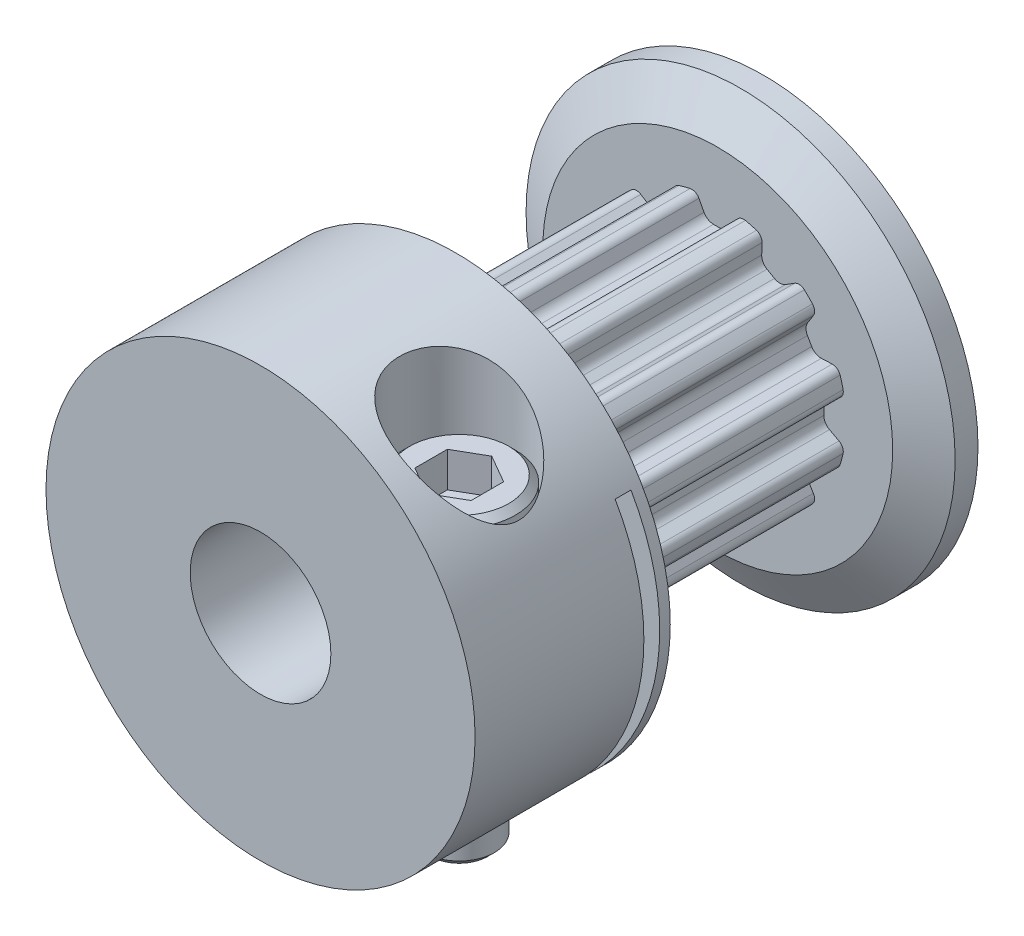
from build123d import *

# Parameters (mm, degrees)
SKETCH1_W               = 6
SKETCH1_H               = 4.6
SKETCH2_W               = 0.45
SKETCH2_H               = 4.6
CUT_REVOLVE1_ANGLE      = 180
CUT_EXTRUDE1_DEPTH      = 1
EXTRUDE1_START          = 7
SKETCH7_R               = 3.65
SKETCH7_R_2             = 1.5
EXTRUDE1_DEPTH          = 7
CUT_EXTRUDE2_START      = -8.3
CUT_EXTRUDE2_DEPTH      = 8.3
CIRPATTERN1_COUNT       = 12
SKETCH11_R              = 3.285
SKETCH11_R_2            = 1.5
EXTRUDE2_DEPTH          = 0.65
SKETCH12_R              = 2.6004
SKETCH12_R_2            = 2.5496
CUT_EXTRUDE_THIN1_DEPTH = 0.0508
SKETCH13_R              = 2
CUT_EXTRUDE3_DEPTH      = 17.700598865


with BuildPart() as part:
    # Sketch1 → Revolve1 (revolve)
    with BuildSketch(Plane(origin=(0, 0, 0), x_dir=(0, 0, -1), z_dir=(1, 0, 0)), mode=Mode.PRIVATE) as revolve1_sk:
        with Locations((-3, 3.8)):
            Rectangle(SKETCH1_W, SKETCH1_H)
    revolve(revolve1_sk.sketch.rotate(Axis((0, 0, 6.3), (0, 0, -1)), 90), axis=Axis((0, 0, 6.3), (0, 0, -1)))

    # Sketch2 → Cut-Revolve1 (revolve, cut)
    with BuildSketch(Plane(origin=(0, 0, 0), x_dir=(0, 0, -1), z_dir=(-0.49999999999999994, 0.8660254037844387, 0))):
        with Locations((-0.975, 3.8)):
            Rectangle(SKETCH2_W, SKETCH2_H)
    revolve(axis=Axis((0, 0, 1.2225), (0, 0, 1)), revolution_arc=CUT_REVOLVE1_ANGLE, mode=Mode.SUBTRACT)

    # Sketch4 → Cut-Revolve2 (revolve, cut)
    with BuildSketch(Plane.XY.offset(3.6), mode=Mode.PRIVATE) as cut_revolve2_sk:
        Polygon((1.55, 5.899788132), (1.55, 1.83), (2.24, 1.83), (2.24, -5.673834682), (3.25, -5.673834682), (3.25, 5.899788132), align=None)
    revolve(cut_revolve2_sk.sketch.rotate(Axis((3.25, -6.252515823, 3.6), (0, 1, 0)), 90), axis=Axis((3.25, -6.252515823, 3.6), (0, 1, 0)), mode=Mode.SUBTRACT)

    # Sketch5 → Revolve2 (revolve)
    with BuildSketch(Plane(origin=(3.25, 0, 3.6), x_dir=(1, 0, 0), z_dir=(0, 0, 1)), mode=Mode.PRIVATE) as revolve2_sk:
        Polygon((1.6, 3.6395), (1.6, 1.83), (1, 1.83), (1, -4.971621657), (0.8095, -5.162121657), (0, -5.162121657), (0, 3.83), (1.4095, 3.83), align=None)
    revolve(revolve2_sk.sketch.rotate(Axis((3.25, -5.61172774, 3.6), (0, 1, 0)), 90), axis=Axis((3.25, -5.61172774, 3.6), (0, 1, 0)))

    # Sketch6 → Cut-Extrude1 (cut)
    with BuildSketch(Plane(origin=(0, 3.83, 0), x_dir=(-1, 0, 0), z_dir=(0, 1, 0))):
        Polygon((-3.25, 2.676239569), (-2.45, 3.138119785), (-2.45, 4.061880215), (-3.25, 4.523760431), (-4.05, 4.061880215), (-4.05, 3.138119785), align=None)
    extrude(amount=-CUT_EXTRUDE1_DEPTH, mode=Mode.SUBTRACT)

    # Sketch7 → Extrude1 (add)
    with BuildSketch(Plane(origin=(0, 0, 0), x_dir=(-1, 0, 0), z_dir=(0, 0, -1)).offset(EXTRUDE1_START)):
        with Locations(Location((0, 0, 0), (0, 0, 180))):
            Circle(SKETCH7_R)
        with Locations(Location((0, 0, 0), (0, 0, 180))):
            Circle(SKETCH7_R_2, mode=Mode.SUBTRACT)
    extrude(amount=-EXTRUDE1_DEPTH)

    # Sketch8 → Cut-Extrude2 (cut)
    with BuildSketch(Plane(origin=(0, 0, 0), x_dir=(0.8660254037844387, -0.49999999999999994, 0), z_dir=(0, 0, 1)).offset(CUT_EXTRUDE2_START)):
        with BuildLine():
            Line((0.121657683, 3.015), (-0.121657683, 3.015))
            ThreePointArc((-0.121657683, 3.015), (-0.278641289, 3.058535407), (-0.39078011, 3.176705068))
            Line((-0.39078011, 3.176705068), (-0.535234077, 3.448383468))
            ThreePointArc((-0.535234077, 3.448383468), (-0.641263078, 3.548614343), (-0.786323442, 3.564294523))
            ThreePointArc((-0.786323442, 3.564294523), (0, 3.65), (0.786323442, 3.564294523))
            ThreePointArc((0.786323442, 3.564294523), (0.641263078, 3.548614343), (0.535234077, 3.448383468))
            Line((0.535234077, 3.448383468), (0.39078011, 3.176705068))
            ThreePointArc((0.39078011, 3.176705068), (0.278641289, 3.058535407), (0.121657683, 3.015))
        make_face()
    cut_extrude2 = extrude(amount=CUT_EXTRUDE2_DEPTH, mode=Mode.SUBTRACT)

    # CirPattern1: Cut-Extrude2 ×12 about axis
    cirpattern1_axis = Axis((0, 0, 0), (0, 0, 1))
    for i in range(1, CIRPATTERN1_COUNT):
        add(cut_extrude2.rotate(cirpattern1_axis, i * 360 / CIRPATTERN1_COUNT), mode=Mode.SUBTRACT)

    # Sketch9 → Revolve3 (revolve)
    with BuildSketch(Plane(origin=(0, 0, 0), x_dir=(0, 0, -1), z_dir=(1, 0, 0)), mode=Mode.PRIVATE) as revolve3_sk:
        Polygon((7, 1.5), (7, 4.974166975), (7.65, 6.1), (8.3, 6.1), (7.65, 4.974166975), (7.65, 1.5), align=None)
    revolve(revolve3_sk.sketch.rotate(Axis((0, 0, 0.415), (0, 0, -1)), 90), axis=Axis((0, 0, 0.415), (0, 0, -1)))

    # Sketch10 → Cut-Revolve3 (revolve, cut)
    with BuildSketch(Plane(origin=(0, 0, 0), x_dir=(0, 0, -1), z_dir=(1, 0, 0)), mode=Mode.PRIVATE) as cut_revolve3_sk:
        Polygon((0, 4.974166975), (-0.45, 6.1), (0, 6.1), align=None)
    revolve(cut_revolve3_sk.sketch.rotate(Axis((0, 0, 0.8225), (0, 0, -1)), 90), axis=Axis((0, 0, 0.8225), (0, 0, -1)), mode=Mode.SUBTRACT)

    # Sketch11 → Extrude2 (add)
    with BuildSketch(Plane(origin=(0, 0, -7.65), x_dir=(-1, 0, 0), z_dir=(0, 0, -1))):
        with Locations(Location((0, 0, 0), (0, 0, 180))):
            Circle(SKETCH11_R)
        with Locations(Location((0, 0, 0), (0, 0, 180))):
            Circle(SKETCH11_R_2, mode=Mode.SUBTRACT)
    extrude(amount=EXTRUDE2_DEPTH)

    # Sketch12 → Cut-Extrude-Thin1 (cut)
    with BuildSketch(Plane(origin=(0, 0, -8.3), x_dir=(-1, 0, 0), z_dir=(0, 0, -1))):
        Circle(SKETCH12_R)
        Circle(SKETCH12_R_2, mode=Mode.SUBTRACT)
    extrude(amount=-CUT_EXTRUDE_THIN1_DEPTH, mode=Mode.SUBTRACT)

    # Sketch13 → Cut-Extrude3 (cut, through all)
    with BuildSketch(Plane.XY.offset(6)):
        Circle(SKETCH13_R)
    extrude(amount=-CUT_EXTRUDE3_DEPTH, mode=Mode.SUBTRACT)


solid = part.part
